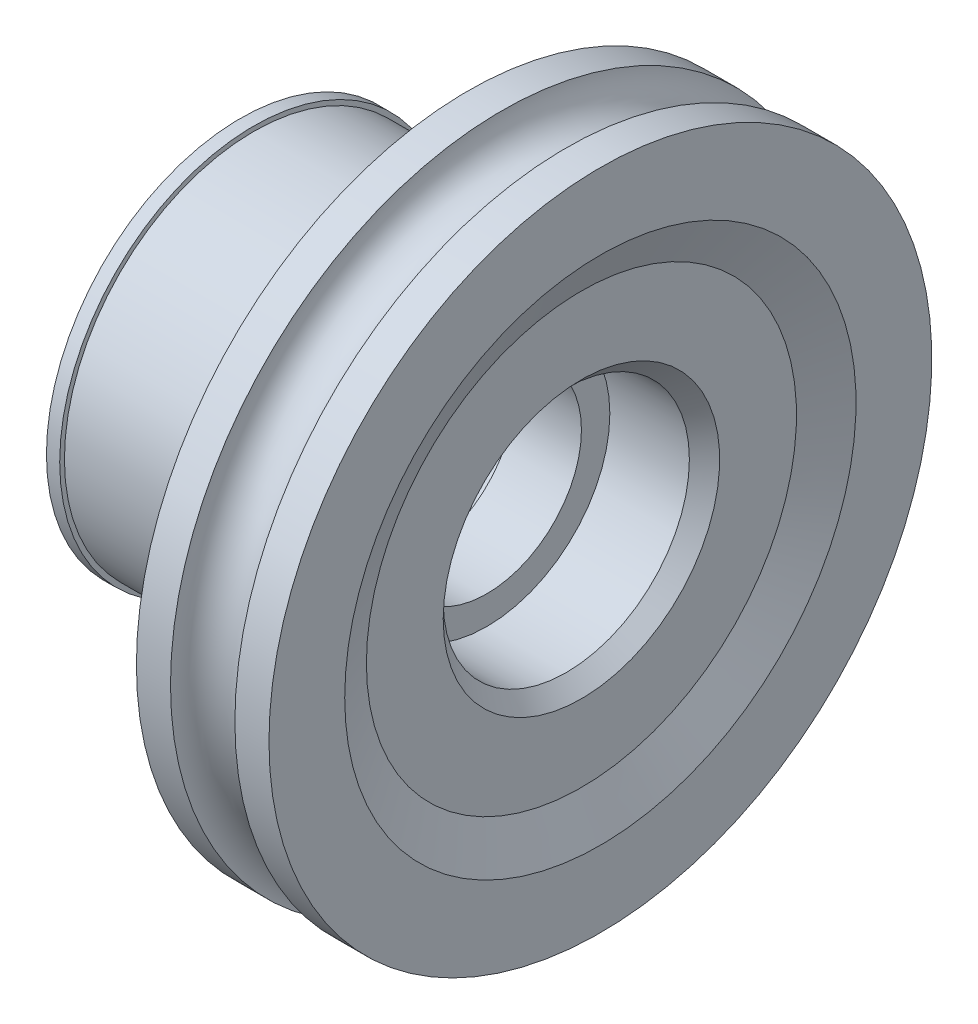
ISO-10303-21;
HEADER;
FILE_DESCRIPTION(('STEP AP214'),'2;1');
FILE_NAME('part.step','',(''),(''),'','','');
FILE_SCHEMA(('AUTOMOTIVE_DESIGN { 1 0 10303 214 1 1 1 1 }'));
ENDSEC;
DATA;
#1=APPLICATION_CONTEXT('core data for automotive mechanical design processes');
#2=APPLICATION_PROTOCOL_DEFINITION('international standard','automotive_design',2000,#1);
#3=PRODUCT_CONTEXT('',#1,'mechanical');
#4=PRODUCT('Part','Part','',(#3));
#5=PRODUCT_RELATED_PRODUCT_CATEGORY('part','',(#4));
#6=PRODUCT_DEFINITION_FORMATION('','',#4);
#7=PRODUCT_DEFINITION_CONTEXT('part definition',#1,'design');
#8=PRODUCT_DEFINITION('design','',#6,#7);
#9=PRODUCT_DEFINITION_SHAPE('','',#8);
#10=(LENGTH_UNIT() NAMED_UNIT(*) SI_UNIT(.MILLI.,.METRE.));
#11=(NAMED_UNIT(*) PLANE_ANGLE_UNIT() SI_UNIT($,.RADIAN.));
#12=(NAMED_UNIT(*) SI_UNIT($,.STERADIAN.) SOLID_ANGLE_UNIT());
#13=UNCERTAINTY_MEASURE_WITH_UNIT(LENGTH_MEASURE(1.E-05),#10,'distance_accuracy_value','');
#14=(GEOMETRIC_REPRESENTATION_CONTEXT(3) GLOBAL_UNCERTAINTY_ASSIGNED_CONTEXT((#13)) GLOBAL_UNIT_ASSIGNED_CONTEXT((#10,
#11,#12)) REPRESENTATION_CONTEXT('',''));
#15=CARTESIAN_POINT('',(0.,0.,0.));
#16=DIRECTION('',(0.,0.,1.));
#17=DIRECTION('',(1.,0.,0.));
#18=AXIS2_PLACEMENT_3D('',#15,#16,#17);
#19=CARTESIAN_POINT('',(-2.,0.,0.));
#20=DIRECTION('',(1.,0.,0.));
#21=DIRECTION('',(0.,0.,-1.));
#22=AXIS2_PLACEMENT_3D('',#19,#20,#21);
#23=CYLINDRICAL_SURFACE('',#22,5.);
#24=CARTESIAN_POINT('',(13.,0.,0.));
#25=DIRECTION('',(1.,0.,0.));
#26=DIRECTION('',(0.,0.,-1.));
#27=AXIS2_PLACEMENT_3D('',#24,#25,#26);
#28=CIRCLE('',#27,5.);
#29=CARTESIAN_POINT('',(13.,0.,-5.));
#30=VERTEX_POINT('',#29);
#31=EDGE_CURVE('E83',#30,#30,#28,.T.);
#32=ORIENTED_EDGE('',*,*,#31,.T.);
#33=EDGE_LOOP('',(#32));
#34=FACE_BOUND('',#33,.T.);
#35=CARTESIAN_POINT('',(9.5,0.,0.));
#36=DIRECTION('',(-1.,0.,0.));
#37=DIRECTION('',(0.,0.,1.));
#38=AXIS2_PLACEMENT_3D('',#35,#36,#37);
#39=CIRCLE('',#38,5.);
#40=CARTESIAN_POINT('',(9.5,0.,5.));
#41=VERTEX_POINT('',#40);
#42=EDGE_CURVE('E37',#41,#41,#39,.F.);
#43=ORIENTED_EDGE('',*,*,#42,.F.);
#44=EDGE_LOOP('',(#43));
#45=FACE_BOUND('',#44,.T.);
#46=ADVANCED_FACE('F16',(#34,#45),#23,.F.);
#47=CARTESIAN_POINT('',(18.,11.3554930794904,0.));
#48=DIRECTION('',(-1.,0.,0.));
#49=DIRECTION('',(0.,0.,1.));
#50=AXIS2_PLACEMENT_3D('',#47,#48,#49);
#51=PLANE('',#50);
#52=CARTESIAN_POINT('',(18.,0.,0.));
#53=DIRECTION('',(-1.,0.,0.));
#54=DIRECTION('',(0.,0.,1.));
#55=AXIS2_PLACEMENT_3D('',#52,#53,#54);
#56=CIRCLE('',#55,7.3);
#57=CARTESIAN_POINT('',(18.,0.,7.3));
#58=VERTEX_POINT('',#57);
#59=EDGE_CURVE('E27',#58,#58,#56,.T.);
#60=ORIENTED_EDGE('',*,*,#59,.T.);
#61=EDGE_LOOP('',(#60));
#62=FACE_BOUND('',#61,.T.);
#63=CARTESIAN_POINT('',(18.,0.,0.));
#64=DIRECTION('',(-1.,0.,0.));
#65=DIRECTION('',(0.,0.,1.));
#66=AXIS2_PLACEMENT_3D('',#63,#64,#65);
#67=CIRCLE('',#66,11.3554930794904);
#68=CARTESIAN_POINT('',(18.,0.,11.3554930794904));
#69=VERTEX_POINT('',#68);
#70=EDGE_CURVE('E36',#69,#69,#67,.T.);
#71=ORIENTED_EDGE('',*,*,#70,.F.);
#72=EDGE_LOOP('',(#71));
#73=FACE_BOUND('',#72,.T.);
#74=ADVANCED_FACE('F122',(#62,#73),#51,.F.);
#75=CARTESIAN_POINT('',(18.,0.,0.));
#76=DIRECTION('',(1.,0.,0.));
#77=DIRECTION('',(0.,0.,-1.));
#78=AXIS2_PLACEMENT_3D('',#75,#76,#77);
#79=CONICAL_SURFACE('',#78,11.3554930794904,1.13446401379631);
#80=CARTESIAN_POINT('',(19.,0.,0.));
#81=DIRECTION('',(-1.,0.,0.));
#82=DIRECTION('',(0.,0.,1.));
#83=AXIS2_PLACEMENT_3D('',#80,#81,#82);
#84=CIRCLE('',#83,13.5);
#85=CARTESIAN_POINT('',(19.,0.,13.5));
#86=VERTEX_POINT('',#85);
#87=EDGE_CURVE('E44',#86,#86,#84,.T.);
#88=ORIENTED_EDGE('',*,*,#87,.F.);
#89=EDGE_LOOP('',(#88));
#90=FACE_BOUND('',#89,.T.);
#91=ORIENTED_EDGE('',*,*,#70,.T.);
#92=EDGE_LOOP('',(#91));
#93=FACE_BOUND('',#92,.T.);
#94=ADVANCED_FACE('F128',(#90,#93),#79,.F.);
#95=CARTESIAN_POINT('',(19.,17.5,0.));
#96=DIRECTION('',(-1.,0.,0.));
#97=DIRECTION('',(0.,0.,1.));
#98=AXIS2_PLACEMENT_3D('',#95,#96,#97);
#99=PLANE('',#98);
#100=CARTESIAN_POINT('',(19.,0.,0.));
#101=DIRECTION('',(-1.,0.,0.));
#102=DIRECTION('',(0.,0.,1.));
#103=AXIS2_PLACEMENT_3D('',#100,#101,#102);
#104=CIRCLE('',#103,17.5);
#105=CARTESIAN_POINT('',(19.,0.,17.5));
#106=VERTEX_POINT('',#105);
#107=EDGE_CURVE('E47',#106,#106,#104,.T.);
#108=ORIENTED_EDGE('',*,*,#107,.F.);
#109=EDGE_LOOP('',(#108));
#110=FACE_BOUND('',#109,.T.);
#111=ORIENTED_EDGE('',*,*,#87,.T.);
#112=EDGE_LOOP('',(#111));
#113=FACE_BOUND('',#112,.T.);
#114=ADVANCED_FACE('F182',(#110,#113),#99,.F.);
#115=CARTESIAN_POINT('',(0.,0.,0.));
#116=DIRECTION('',(-1.,0.,0.));
#117=DIRECTION('',(0.,0.,1.));
#118=AXIS2_PLACEMENT_3D('',#115,#116,#117);
#119=CYLINDRICAL_SURFACE('',#118,17.5);
#120=CARTESIAN_POINT('',(17.2,0.,0.));
#121=DIRECTION('',(-1.,0.,0.));
#122=DIRECTION('',(0.,0.,1.));
#123=AXIS2_PLACEMENT_3D('',#120,#121,#122);
#124=CIRCLE('',#123,17.5);
#125=CARTESIAN_POINT('',(17.2,0.,17.5));
#126=VERTEX_POINT('',#125);
#127=EDGE_CURVE('E50',#126,#126,#124,.T.);
#128=ORIENTED_EDGE('',*,*,#127,.F.);
#129=EDGE_LOOP('',(#128));
#130=FACE_BOUND('',#129,.T.);
#131=ORIENTED_EDGE('',*,*,#107,.T.);
#132=EDGE_LOOP('',(#131));
#133=FACE_BOUND('',#132,.T.);
#134=ADVANCED_FACE('F178',(#130,#133),#119,.T.);
#135=CARTESIAN_POINT('',(15.5,0.,0.));
#136=DIRECTION('',(-1.,0.,0.));
#137=DIRECTION('',(0.,0.,1.));
#138=AXIS2_PLACEMENT_3D('',#135,#136,#137);
#139=TOROIDAL_SURFACE('',#138,17.5,1.7);
#140=CARTESIAN_POINT('',(13.8,0.,0.));
#141=DIRECTION('',(-1.,0.,0.));
#142=DIRECTION('',(0.,0.,1.));
#143=AXIS2_PLACEMENT_3D('',#140,#141,#142);
#144=CIRCLE('',#143,17.5);
#145=CARTESIAN_POINT('',(13.8,0.,17.5));
#146=VERTEX_POINT('',#145);
#147=EDGE_CURVE('E53',#146,#146,#144,.T.);
#148=ORIENTED_EDGE('',*,*,#147,.F.);
#149=EDGE_LOOP('',(#148));
#150=FACE_BOUND('',#149,.T.);
#151=ORIENTED_EDGE('',*,*,#127,.T.);
#152=EDGE_LOOP('',(#151));
#153=FACE_BOUND('',#152,.T.);
#154=ADVANCED_FACE('F174',(#150,#153),#139,.F.);
#155=CARTESIAN_POINT('',(0.,0.,0.));
#156=DIRECTION('',(-1.,0.,0.));
#157=DIRECTION('',(0.,0.,1.));
#158=AXIS2_PLACEMENT_3D('',#155,#156,#157);
#159=CYLINDRICAL_SURFACE('',#158,17.5);
#160=CARTESIAN_POINT('',(12.,0.,0.));
#161=DIRECTION('',(-1.,0.,0.));
#162=DIRECTION('',(0.,0.,1.));
#163=AXIS2_PLACEMENT_3D('',#160,#161,#162);
#164=CIRCLE('',#163,17.5);
#165=CARTESIAN_POINT('',(12.,0.,17.5));
#166=VERTEX_POINT('',#165);
#167=EDGE_CURVE('E56',#166,#166,#164,.T.);
#168=ORIENTED_EDGE('',*,*,#167,.F.);
#169=EDGE_LOOP('',(#168));
#170=FACE_BOUND('',#169,.T.);
#171=ORIENTED_EDGE('',*,*,#147,.T.);
#172=EDGE_LOOP('',(#171));
#173=FACE_BOUND('',#172,.T.);
#174=ADVANCED_FACE('F170',(#170,#173),#159,.T.);
#175=CARTESIAN_POINT('',(12.,14.3,0.));
#176=DIRECTION('',(1.,0.,0.));
#177=DIRECTION('',(0.,0.,-1.));
#178=AXIS2_PLACEMENT_3D('',#175,#176,#177);
#179=PLANE('',#178);
#180=CARTESIAN_POINT('',(12.,0.,0.));
#181=DIRECTION('',(-1.,0.,0.));
#182=DIRECTION('',(0.,0.,1.));
#183=AXIS2_PLACEMENT_3D('',#180,#181,#182);
#184=CIRCLE('',#183,14.3);
#185=CARTESIAN_POINT('',(12.,0.,14.3));
#186=VERTEX_POINT('',#185);
#187=EDGE_CURVE('E59',#186,#186,#184,.T.);
#188=ORIENTED_EDGE('',*,*,#187,.F.);
#189=EDGE_LOOP('',(#188));
#190=FACE_BOUND('',#189,.T.);
#191=ORIENTED_EDGE('',*,*,#167,.T.);
#192=EDGE_LOOP('',(#191));
#193=FACE_BOUND('',#192,.T.);
#194=ADVANCED_FACE('F166',(#190,#193),#179,.F.);
#195=CARTESIAN_POINT('',(12.,0.,0.));
#196=DIRECTION('',(1.,0.,0.));
#197=DIRECTION('',(0.,0.,-1.));
#198=AXIS2_PLACEMENT_3D('',#195,#196,#197);
#199=CONICAL_SURFACE('',#198,14.3,0.785398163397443);
#200=CARTESIAN_POINT('',(9.7,0.,0.));
#201=DIRECTION('',(-1.,0.,0.));
#202=DIRECTION('',(0.,0.,1.));
#203=AXIS2_PLACEMENT_3D('',#200,#201,#202);
#204=CIRCLE('',#203,12.);
#205=CARTESIAN_POINT('',(9.7,0.,12.));
#206=VERTEX_POINT('',#205);
#207=EDGE_CURVE('E62',#206,#206,#204,.T.);
#208=ORIENTED_EDGE('',*,*,#207,.F.);
#209=EDGE_LOOP('',(#208));
#210=FACE_BOUND('',#209,.T.);
#211=ORIENTED_EDGE('',*,*,#187,.T.);
#212=EDGE_LOOP('',(#211));
#213=FACE_BOUND('',#212,.T.);
#214=ADVANCED_FACE('F162',(#210,#213),#199,.T.);
#215=CARTESIAN_POINT('',(0.,0.,0.));
#216=DIRECTION('',(-1.,0.,0.));
#217=DIRECTION('',(0.,0.,1.));
#218=AXIS2_PLACEMENT_3D('',#215,#216,#217);
#219=CYLINDRICAL_SURFACE('',#218,12.);
#220=CARTESIAN_POINT('',(8.7,0.,0.));
#221=DIRECTION('',(-1.,0.,0.));
#222=DIRECTION('',(0.,0.,1.));
#223=AXIS2_PLACEMENT_3D('',#220,#221,#222);
#224=CIRCLE('',#223,12.);
#225=CARTESIAN_POINT('',(8.7,0.,12.));
#226=VERTEX_POINT('',#225);
#227=EDGE_CURVE('E65',#226,#226,#224,.T.);
#228=ORIENTED_EDGE('',*,*,#227,.F.);
#229=EDGE_LOOP('',(#228));
#230=FACE_BOUND('',#229,.T.);
#231=ORIENTED_EDGE('',*,*,#207,.T.);
#232=EDGE_LOOP('',(#231));
#233=FACE_BOUND('',#232,.T.);
#234=ADVANCED_FACE('F158',(#230,#233),#219,.T.);
#235=CARTESIAN_POINT('',(8.7,10.,0.));
#236=DIRECTION('',(1.,0.,0.));
#237=DIRECTION('',(0.,0.,-1.));
#238=AXIS2_PLACEMENT_3D('',#235,#236,#237);
#239=PLANE('',#238);
#240=CARTESIAN_POINT('',(8.7,0.,0.));
#241=DIRECTION('',(-1.,0.,0.));
#242=DIRECTION('',(0.,0.,1.));
#243=AXIS2_PLACEMENT_3D('',#240,#241,#242);
#244=CIRCLE('',#243,10.);
#245=CARTESIAN_POINT('',(8.7,0.,10.));
#246=VERTEX_POINT('',#245);
#247=EDGE_CURVE('E68',#246,#246,#244,.T.);
#248=ORIENTED_EDGE('',*,*,#247,.F.);
#249=EDGE_LOOP('',(#248));
#250=FACE_BOUND('',#249,.T.);
#251=ORIENTED_EDGE('',*,*,#227,.T.);
#252=EDGE_LOOP('',(#251));
#253=FACE_BOUND('',#252,.T.);
#254=ADVANCED_FACE('F154',(#250,#253),#239,.F.);
#255=CARTESIAN_POINT('',(0.,0.,0.));
#256=DIRECTION('',(-1.,0.,0.));
#257=DIRECTION('',(0.,0.,1.));
#258=AXIS2_PLACEMENT_3D('',#255,#256,#257);
#259=CYLINDRICAL_SURFACE('',#258,10.);
#260=CARTESIAN_POINT('',(0.7,0.,0.));
#261=DIRECTION('',(-1.,0.,0.));
#262=DIRECTION('',(0.,0.,1.));
#263=AXIS2_PLACEMENT_3D('',#260,#261,#262);
#264=CIRCLE('',#263,10.);
#265=CARTESIAN_POINT('',(0.7,0.,10.));
#266=VERTEX_POINT('',#265);
#267=EDGE_CURVE('E71',#266,#266,#264,.T.);
#268=ORIENTED_EDGE('',*,*,#267,.F.);
#269=EDGE_LOOP('',(#268));
#270=FACE_BOUND('',#269,.T.);
#271=ORIENTED_EDGE('',*,*,#247,.T.);
#272=EDGE_LOOP('',(#271));
#273=FACE_BOUND('',#272,.T.);
#274=ADVANCED_FACE('F150',(#270,#273),#259,.T.);
#275=CARTESIAN_POINT('',(0.7,10.25,0.));
#276=DIRECTION('',(-1.,0.,0.));
#277=DIRECTION('',(0.,0.,1.));
#278=AXIS2_PLACEMENT_3D('',#275,#276,#277);
#279=PLANE('',#278);
#280=CARTESIAN_POINT('',(0.7,0.,0.));
#281=DIRECTION('',(-1.,0.,0.));
#282=DIRECTION('',(0.,0.,1.));
#283=AXIS2_PLACEMENT_3D('',#280,#281,#282);
#284=CIRCLE('',#283,10.25);
#285=CARTESIAN_POINT('',(0.7,0.,10.25));
#286=VERTEX_POINT('',#285);
#287=EDGE_CURVE('E74',#286,#286,#284,.T.);
#288=ORIENTED_EDGE('',*,*,#287,.F.);
#289=EDGE_LOOP('',(#288));
#290=FACE_BOUND('',#289,.T.);
#291=ORIENTED_EDGE('',*,*,#267,.T.);
#292=EDGE_LOOP('',(#291));
#293=FACE_BOUND('',#292,.T.);
#294=ADVANCED_FACE('F146',(#290,#293),#279,.F.);
#295=CARTESIAN_POINT('',(0.,0.,0.));
#296=DIRECTION('',(-1.,0.,0.));
#297=DIRECTION('',(0.,0.,1.));
#298=AXIS2_PLACEMENT_3D('',#295,#296,#297);
#299=CYLINDRICAL_SURFACE('',#298,10.25);
#300=CARTESIAN_POINT('',(0.,0.,0.));
#301=DIRECTION('',(-1.,0.,0.));
#302=DIRECTION('',(0.,0.,1.));
#303=AXIS2_PLACEMENT_3D('',#300,#301,#302);
#304=CIRCLE('',#303,10.25);
#305=CARTESIAN_POINT('',(0.,0.,10.25));
#306=VERTEX_POINT('',#305);
#307=EDGE_CURVE('E77',#306,#306,#304,.T.);
#308=ORIENTED_EDGE('',*,*,#307,.F.);
#309=EDGE_LOOP('',(#308));
#310=FACE_BOUND('',#309,.T.);
#311=ORIENTED_EDGE('',*,*,#287,.T.);
#312=EDGE_LOOP('',(#311));
#313=FACE_BOUND('',#312,.T.);
#314=ADVANCED_FACE('F143',(#310,#313),#299,.T.);
#315=CARTESIAN_POINT('',(0.,0.,0.));
#316=DIRECTION('',(1.,0.,0.));
#317=DIRECTION('',(0.,0.,-1.));
#318=AXIS2_PLACEMENT_3D('',#315,#316,#317);
#319=PLANE('',#318);
#320=CARTESIAN_POINT('',(0.,0.,0.));
#321=DIRECTION('',(1.,0.,0.));
#322=DIRECTION('',(0.,0.,-1.));
#323=AXIS2_PLACEMENT_3D('',#320,#321,#322);
#324=CIRCLE('',#323,8.05);
#325=CARTESIAN_POINT('',(0.,0.,-8.05));
#326=VERTEX_POINT('',#325);
#327=EDGE_CURVE('E10',#326,#326,#324,.T.);
#328=ORIENTED_EDGE('',*,*,#327,.T.);
#329=EDGE_LOOP('',(#328));
#330=FACE_BOUND('',#329,.T.);
#331=ORIENTED_EDGE('',*,*,#307,.T.);
#332=EDGE_LOOP('',(#331));
#333=FACE_BOUND('',#332,.T.);
#334=ADVANCED_FACE('F139',(#330,#333),#319,.F.);
#335=CARTESIAN_POINT('',(13.,0.,0.));
#336=DIRECTION('',(1.,0.,0.));
#337=DIRECTION('',(0.,0.,-1.));
#338=AXIS2_PLACEMENT_3D('',#335,#336,#337);
#339=CYLINDRICAL_SURFACE('',#338,6.5);
#340=CARTESIAN_POINT('',(17.2,0.,0.));
#341=DIRECTION('',(-1.,0.,0.));
#342=DIRECTION('',(0.,0.,1.));
#343=AXIS2_PLACEMENT_3D('',#340,#341,#342);
#344=CIRCLE('',#343,6.5);
#345=CARTESIAN_POINT('',(17.2,0.,6.5));
#346=VERTEX_POINT('',#345);
#347=EDGE_CURVE('E31',#346,#346,#344,.F.);
#348=ORIENTED_EDGE('',*,*,#347,.T.);
#349=EDGE_LOOP('',(#348));
#350=FACE_BOUND('',#349,.T.);
#351=CARTESIAN_POINT('',(13.,0.,0.));
#352=DIRECTION('',(1.,0.,0.));
#353=DIRECTION('',(0.,0.,-1.));
#354=AXIS2_PLACEMENT_3D('',#351,#352,#353);
#355=CIRCLE('',#354,6.5);
#356=CARTESIAN_POINT('',(13.,0.,-6.5));
#357=VERTEX_POINT('',#356);
#358=EDGE_CURVE('E80',#357,#357,#355,.T.);
#359=ORIENTED_EDGE('',*,*,#358,.F.);
#360=EDGE_LOOP('',(#359));
#361=FACE_BOUND('',#360,.T.);
#362=ADVANCED_FACE('F135',(#350,#361),#339,.F.);
#363=CARTESIAN_POINT('',(13.,0.,0.));
#364=DIRECTION('',(1.,0.,0.));
#365=DIRECTION('',(0.,0.,-1.));
#366=AXIS2_PLACEMENT_3D('',#363,#364,#365);
#367=PLANE('',#366);
#368=ORIENTED_EDGE('',*,*,#31,.F.);
#369=EDGE_LOOP('',(#368));
#370=FACE_BOUND('',#369,.T.);
#371=ORIENTED_EDGE('',*,*,#358,.T.);
#372=EDGE_LOOP('',(#371));
#373=FACE_BOUND('',#372,.T.);
#374=ADVANCED_FACE('F108',(#370,#373),#367,.T.);
#375=CARTESIAN_POINT('',(4.5,0.,0.));
#376=DIRECTION('',(-1.,0.,0.));
#377=DIRECTION('',(0.,0.,1.));
#378=AXIS2_PLACEMENT_3D('',#375,#376,#377);
#379=PLANE('',#378);
#380=CARTESIAN_POINT('',(4.5,0.,0.));
#381=DIRECTION('',(-1.,0.,0.));
#382=DIRECTION('',(0.,0.,1.));
#383=AXIS2_PLACEMENT_3D('',#380,#381,#382);
#384=CIRCLE('',#383,6.5);
#385=CARTESIAN_POINT('',(4.5,0.,6.5));
#386=VERTEX_POINT('',#385);
#387=EDGE_CURVE('E88',#386,#386,#384,.T.);
#388=ORIENTED_EDGE('',*,*,#387,.F.);
#389=EDGE_LOOP('',(#388));
#390=FACE_BOUND('',#389,.T.);
#391=CARTESIAN_POINT('',(4.5,0.,0.));
#392=DIRECTION('',(-1.,0.,0.));
#393=DIRECTION('',(0.,0.,1.));
#394=AXIS2_PLACEMENT_3D('',#391,#392,#393);
#395=CIRCLE('',#394,7.25);
#396=CARTESIAN_POINT('',(4.5,0.,7.25));
#397=VERTEX_POINT('',#396);
#398=EDGE_CURVE('E40',#397,#397,#395,.T.);
#399=ORIENTED_EDGE('',*,*,#398,.T.);
#400=EDGE_LOOP('',(#399));
#401=FACE_BOUND('',#400,.T.);
#402=ADVANCED_FACE('F104',(#390,#401),#379,.T.);
#403=CARTESIAN_POINT('',(4.5,0.,0.));
#404=DIRECTION('',(-1.,0.,0.));
#405=DIRECTION('',(0.,0.,1.));
#406=AXIS2_PLACEMENT_3D('',#403,#404,#405);
#407=CYLINDRICAL_SURFACE('',#406,7.25);
#408=CARTESIAN_POINT('',(0.8,0.,0.));
#409=DIRECTION('',(1.,0.,0.));
#410=DIRECTION('',(0.,0.,-1.));
#411=AXIS2_PLACEMENT_3D('',#408,#409,#410);
#412=CIRCLE('',#411,7.25);
#413=CARTESIAN_POINT('',(0.8,0.,-7.25));
#414=VERTEX_POINT('',#413);
#415=EDGE_CURVE('E23',#414,#414,#412,.F.);
#416=ORIENTED_EDGE('',*,*,#415,.T.);
#417=EDGE_LOOP('',(#416));
#418=FACE_BOUND('',#417,.T.);
#419=ORIENTED_EDGE('',*,*,#398,.F.);
#420=EDGE_LOOP('',(#419));
#421=FACE_BOUND('',#420,.T.);
#422=ADVANCED_FACE('F107',(#418,#421),#407,.F.);
#423=CARTESIAN_POINT('',(9.5,0.,0.));
#424=DIRECTION('',(-1.,0.,0.));
#425=DIRECTION('',(0.,0.,1.));
#426=AXIS2_PLACEMENT_3D('',#423,#424,#425);
#427=PLANE('',#426);
#428=CARTESIAN_POINT('',(9.5,0.,0.));
#429=DIRECTION('',(-1.,0.,0.));
#430=DIRECTION('',(0.,0.,1.));
#431=AXIS2_PLACEMENT_3D('',#428,#429,#430);
#432=CIRCLE('',#431,6.5);
#433=CARTESIAN_POINT('',(9.5,0.,6.5));
#434=VERTEX_POINT('',#433);
#435=EDGE_CURVE('E41',#434,#434,#432,.T.);
#436=ORIENTED_EDGE('',*,*,#435,.T.);
#437=EDGE_LOOP('',(#436));
#438=FACE_BOUND('',#437,.T.);
#439=ORIENTED_EDGE('',*,*,#42,.T.);
#440=EDGE_LOOP('',(#439));
#441=FACE_BOUND('',#440,.T.);
#442=ADVANCED_FACE('F94',(#438,#441),#427,.T.);
#443=CARTESIAN_POINT('',(9.5,0.,0.));
#444=DIRECTION('',(-1.,0.,0.));
#445=DIRECTION('',(0.,0.,1.));
#446=AXIS2_PLACEMENT_3D('',#443,#444,#445);
#447=CYLINDRICAL_SURFACE('',#446,6.5);
#448=ORIENTED_EDGE('',*,*,#435,.F.);
#449=EDGE_LOOP('',(#448));
#450=FACE_BOUND('',#449,.T.);
#451=ORIENTED_EDGE('',*,*,#387,.T.);
#452=EDGE_LOOP('',(#451));
#453=FACE_BOUND('',#452,.T.);
#454=ADVANCED_FACE('F97',(#450,#453),#447,.F.);
#455=CARTESIAN_POINT('',(17.2,0.,0.));
#456=DIRECTION('',(1.,0.,0.));
#457=DIRECTION('',(0.,0.,-1.));
#458=AXIS2_PLACEMENT_3D('',#455,#456,#457);
#459=CONICAL_SURFACE('',#458,6.5,0.785398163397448);
#460=ORIENTED_EDGE('',*,*,#59,.F.);
#461=EDGE_LOOP('',(#460));
#462=FACE_BOUND('',#461,.T.);
#463=ORIENTED_EDGE('',*,*,#347,.F.);
#464=EDGE_LOOP('',(#463));
#465=FACE_BOUND('',#464,.T.);
#466=ADVANCED_FACE('F100',(#462,#465),#459,.F.);
#467=CARTESIAN_POINT('',(0.8,0.,0.));
#468=DIRECTION('',(-1.,0.,0.));
#469=DIRECTION('',(0.,0.,1.));
#470=AXIS2_PLACEMENT_3D('',#467,#468,#469);
#471=CONICAL_SURFACE('',#470,7.25,0.785398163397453);
#472=ORIENTED_EDGE('',*,*,#327,.F.);
#473=EDGE_LOOP('',(#472));
#474=FACE_BOUND('',#473,.T.);
#475=ORIENTED_EDGE('',*,*,#415,.F.);
#476=EDGE_LOOP('',(#475));
#477=FACE_BOUND('',#476,.T.);
#478=ADVANCED_FACE('F18',(#474,#477),#471,.F.);
#479=CLOSED_SHELL('',(#46,#74,#94,#114,#134,#154,#174,#194,#214,#234,#254,#274,#294,#314,#334,
#362,#374,#402,#422,#442,#454,#466,#478));
#480=MANIFOLD_SOLID_BREP('B1',#479);
#481=ADVANCED_BREP_SHAPE_REPRESENTATION('',(#18,#480),#14);
#482=SHAPE_DEFINITION_REPRESENTATION(#9,#481);
ENDSEC;
END-ISO-10303-21;
